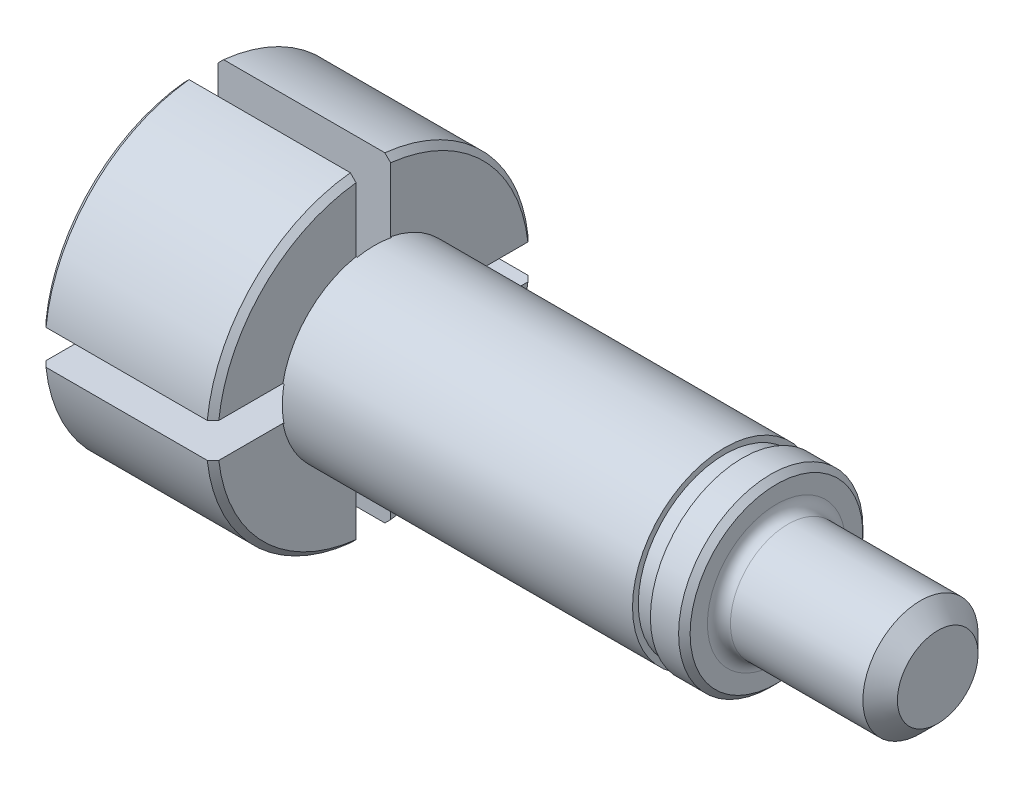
from build123d import *

# Parameters (mm, degrees)
ESQUISSE1_W    = 68
ESQUISSE1_H    = 15
PHASE_30_DEPTH = 15.1


with BuildPart() as part:
    # Esquisse1 → Brut _30 x 50 (revolve)
    with BuildSketch(Plane.XY, mode=Mode.PRIVATE) as brut_30_x_50_sk:
        with Locations((34, 7.5)):
            Rectangle(ESQUISSE1_W, ESQUISSE1_H)
    revolve(brut_30_x_50_sk.sketch.rotate(Axis((-14.953802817, 0, 0), (1, 0, 0)), 90), axis=Axis((-14.953802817, 0, 0), (1, 0, 0)))

    # Esquisse2 → Phase 10 (revolve, cut)
    with BuildSketch(Plane.XY, mode=Mode.PRIVATE) as phase_10_sk:
        Polygon((0, 15), (0, 0), (2, 0), (2, 13.5), (2.5, 14), (24, 14), (24, 15), align=None)
    revolve(phase_10_sk.sketch.rotate(Axis((-1.604068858, 0, 0), (1, 0, 0)), 90), axis=Axis((-1.604068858, 0, 0), (1, 0, 0)), mode=Mode.SUBTRACT)

    # Esquisse3 → Phase 20 (revolve, cut)
    with BuildSketch(Plane.XY, mode=Mode.PRIVATE) as phase_20_sk:
        with BuildLine():
            Line((51.5, 8), (52, 7.5))
            Line((52, 7.5), (52, 6))
            ThreePointArc((52, 6), (52.292893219, 5.292893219), (53, 5))
            Line((53, 5), (64.5, 5))
            Line((64.5, 5), (66, 3.5))
            Line((66, 3.5), (66, 0))
            Line((66, 0), (68, 0))
            Line((68, 0), (68, 15))
            Line((68, 15), (15.5, 15))
            Line((15.5, 15), (17, 13.5))
            Line((17, 13.5), (17, 8))
            Line((17, 8), (47.5, 8))
            Line((47.5, 8), (47.5, 7.5))
            Line((47.5, 7.5), (49.05, 7.5))
            Line((49.05, 7.5), (49.05, 8))
            Line((49.05, 8), (51.5, 8))
        make_face()
    revolve(phase_20_sk.sketch.rotate(Axis((-5.510835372, 0, 0), (1, 0, 0)), 90), axis=Axis((-5.510835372, 0, 0), (1, 0, 0)), mode=Mode.SUBTRACT)

    # Esquisse4 → Phase 30 (cut)
    with BuildSketch(Plane.ZY.offset(-2)):
        with BuildLine():
            Line((1.5, -1.5), (1.5, -15.929532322))
            ThreePointArc((1.5, -15.929532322), (0, -16), (-1.5, -15.929532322))
            Line((-1.5, -15.929532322), (-1.5, -1.5))
            Line((-1.5, -1.5), (-15.929532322, -1.5))
            ThreePointArc((-15.929532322, -1.5), (-16, 0), (-15.929532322, 1.5))
            Line((-15.929532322, 1.5), (-1.5, 1.5))
            Line((-1.5, 1.5), (-1.5, 15.929532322))
            ThreePointArc((-1.5, 15.929532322), (0, 16), (1.5, 15.929532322))
            Line((1.5, 15.929532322), (1.5, 1.5))
            Line((1.5, 1.5), (15.929532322, 1.5))
            ThreePointArc((15.929532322, 1.5), (16, 0), (15.929532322, -1.5))
            Line((15.929532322, -1.5), (1.5, -1.5))
        make_face()
    extrude(amount=-PHASE_30_DEPTH, mode=Mode.SUBTRACT)


solid = part.part
